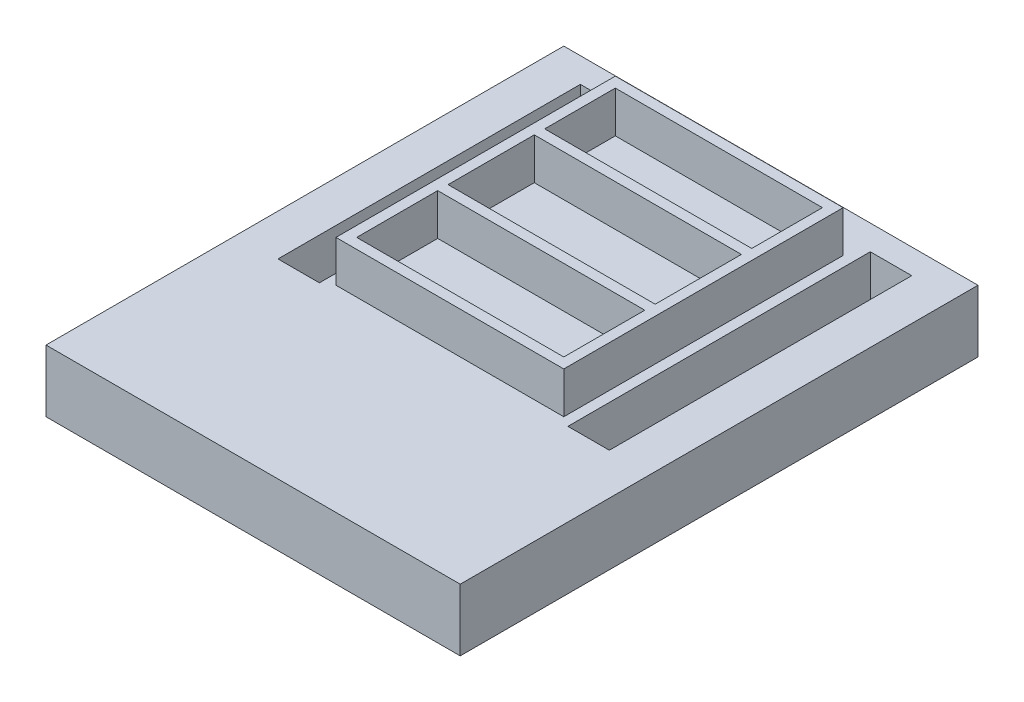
from build123d import *

# Parameters (mm, degrees)
SKETCH1_W               = 200
SKETCH1_H               = 250
BOSS_EXTRUDE1_DEPTH     = 30
CUT_EXTRUDE1_DEPTH      = 163.864974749
CUT_EXTRUDE1_DEPTH_BACK = 163.864974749
SKETCH3_W               = 20
SKETCH3_H               = 146
SKETCH4_W               = 110
SKETCH4_H               = 134.89
SKETCH4_W_2             = 100
SKETCH4_H_2             = 124.89
SKETCH4_H_3             = 5
BOSS_EXTRUDE2_DEPTH     = 20


with BuildPart() as part:
    # Sketch1 → Boss-Extrude1 (new body)
    with BuildSketch(Plane(origin=(0, 0, 0), x_dir=(1, 0, 0), z_dir=(0, 1, 0))):
        Rectangle(SKETCH1_W, SKETCH1_H)
    extrude(amount=BOSS_EXTRUDE1_DEPTH)

    # Sketch3 → Cut-Extrude1 (cut, two sides: drawn at the far end of the back side and taken through both)
    with BuildSketch(Plane(origin=(0, 30, 0), x_dir=(1, 0, 0), z_dir=(0, 1, 0)).offset(-CUT_EXTRUDE1_DEPTH_BACK)):
        with Locations((70, 40)):
            Rectangle(SKETCH3_W, SKETCH3_H)
        with Locations((-70, 40)):
            Rectangle(SKETCH3_W, SKETCH3_H)
    extrude(amount=CUT_EXTRUDE1_DEPTH + CUT_EXTRUDE1_DEPTH_BACK, mode=Mode.SUBTRACT)

    # Sketch4 → Boss-Extrude2 (add)
    # profile 1 of 3: a face of its own
    with BuildSketch(Plane(origin=(0, 30, 0), x_dir=(1, 0, 0), z_dir=(0, 1, 0))):
        with Locations((0, 37.445)):
            Rectangle(SKETCH4_W, SKETCH4_H)
        with Locations((0, 37.445)):
            Rectangle(SKETCH4_W_2, SKETCH4_H_2, mode=Mode.SUBTRACT)
    # profile 2 of 3: a face of its own
    with BuildSketch(Plane(origin=(0, 30, 0), x_dir=(1, 0, 0), z_dir=(0, 1, 0))):
        with Locations((0, 63.26)):
            Rectangle(SKETCH4_W_2, SKETCH4_H_3)
    # profile 3 of 3: a face of its own
    with BuildSketch(Plane(origin=(0, 30, 0), x_dir=(1, 0, 0), z_dir=(0, 1, 0))):
        with Locations((0, 16.63)):
            Rectangle(SKETCH4_W_2, SKETCH4_H_3)
    extrude(amount=BOSS_EXTRUDE2_DEPTH)


solid = part.part
